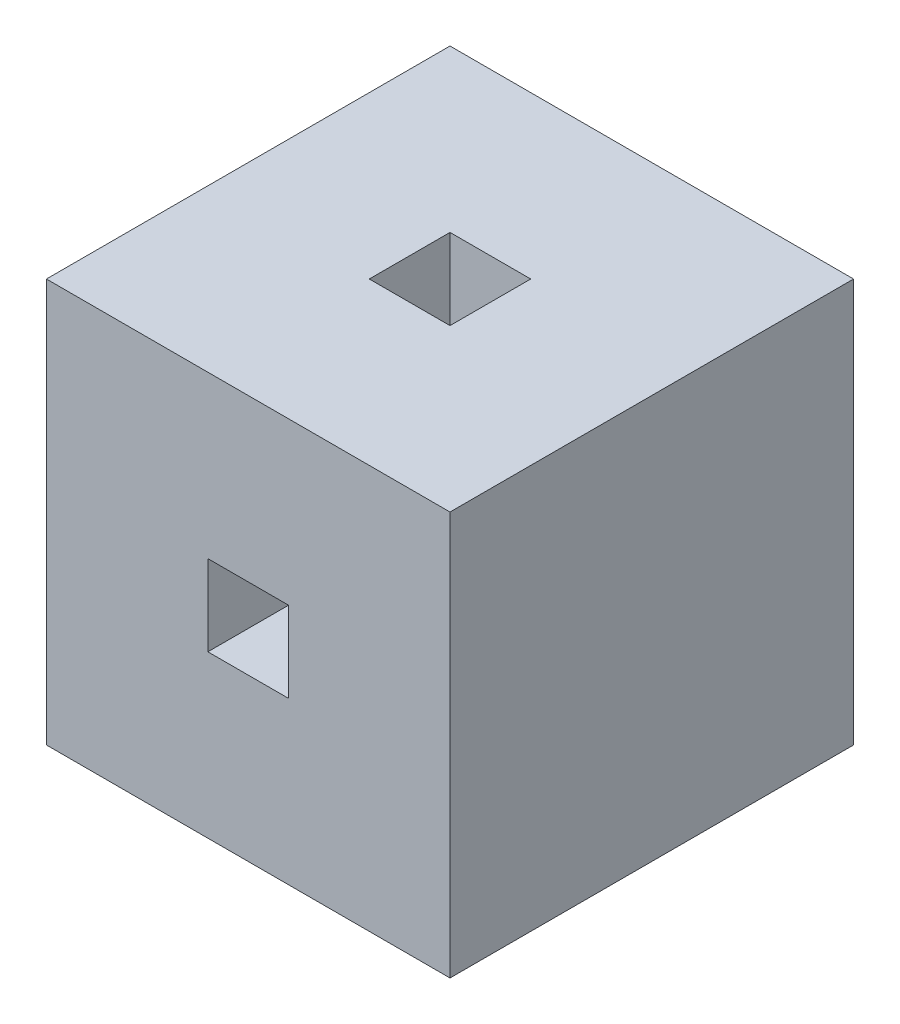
from build123d import *

# Parameters (mm, degrees)
SKIZZE1_W               = 50
SKIZZE1_H               = 50
SKIZZE1_W_2             = 10
SKIZZE1_H_2             = 10
LINEAR_AUSTRAGEN1_DEPTH = 50
SKIZZE2_W               = 10
SKIZZE2_H               = 10
LINEAR_AUSTRAGEN2_DEPTH = 76


with BuildPart() as part:
    # Skizze1 → Linear austragen1 (new body)
    with BuildSketch(Plane.XY):
        Rectangle(SKIZZE1_W, SKIZZE1_H)
        Rectangle(SKIZZE1_W_2, SKIZZE1_H_2, mode=Mode.SUBTRACT)
    extrude(amount=-LINEAR_AUSTRAGEN1_DEPTH)

    # Skizze2 → Linear austragen2 (cut, through all)
    with BuildSketch(Plane(origin=(0, 25, 0), x_dir=(1, 0, 0), z_dir=(0, 1, 0))):
        with Locations((0, 25)):
            Rectangle(SKIZZE2_W, SKIZZE2_H)
    extrude(amount=-LINEAR_AUSTRAGEN2_DEPTH, mode=Mode.SUBTRACT)


solid = part.part
